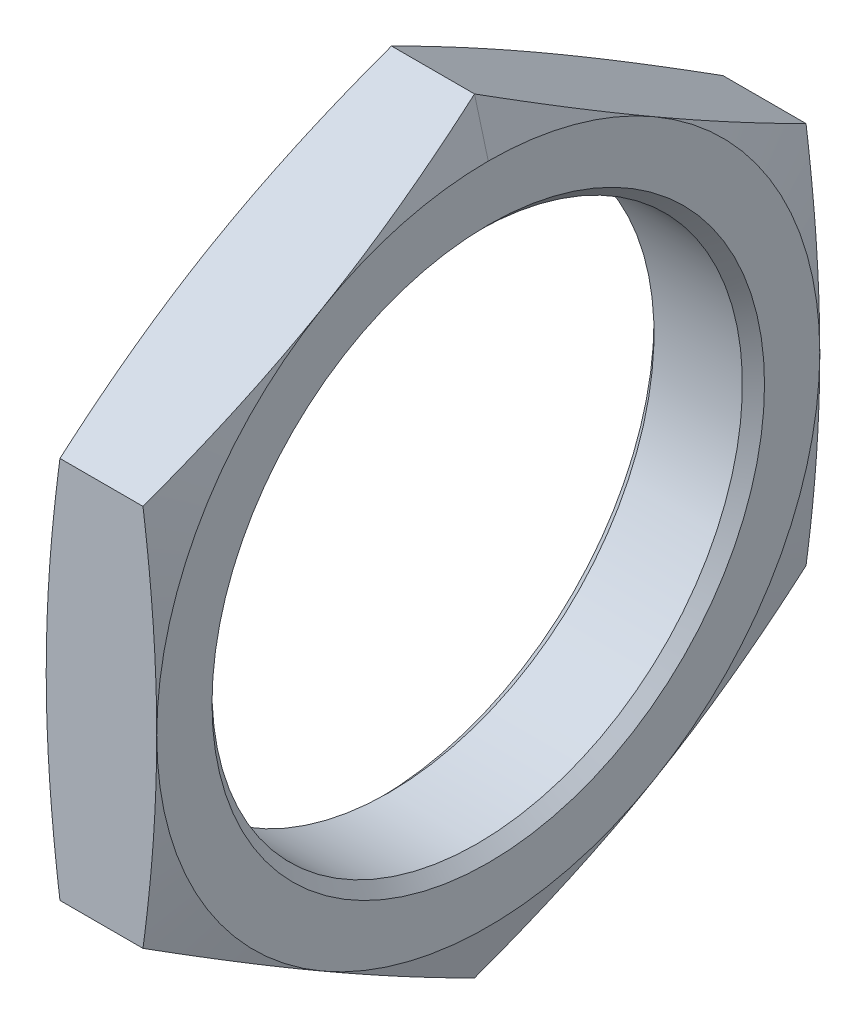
ISO-10303-21;
HEADER;
FILE_DESCRIPTION(('STEP AP214'),'2;1');
FILE_NAME('part.step','',(''),(''),'','','');
FILE_SCHEMA(('AUTOMOTIVE_DESIGN { 1 0 10303 214 1 1 1 1 }'));
ENDSEC;
DATA;
#1=APPLICATION_CONTEXT('core data for automotive mechanical design processes');
#2=APPLICATION_PROTOCOL_DEFINITION('international standard','automotive_design',2000,#1);
#3=PRODUCT_CONTEXT('',#1,'mechanical');
#4=PRODUCT('Part','Part','',(#3));
#5=PRODUCT_RELATED_PRODUCT_CATEGORY('part','',(#4));
#6=PRODUCT_DEFINITION_FORMATION('','',#4);
#7=PRODUCT_DEFINITION_CONTEXT('part definition',#1,'design');
#8=PRODUCT_DEFINITION('design','',#6,#7);
#9=PRODUCT_DEFINITION_SHAPE('','',#8);
#10=(LENGTH_UNIT() NAMED_UNIT(*) SI_UNIT(.MILLI.,.METRE.));
#11=(NAMED_UNIT(*) PLANE_ANGLE_UNIT() SI_UNIT($,.RADIAN.));
#12=(NAMED_UNIT(*) SI_UNIT($,.STERADIAN.) SOLID_ANGLE_UNIT());
#13=UNCERTAINTY_MEASURE_WITH_UNIT(LENGTH_MEASURE(1.E-05),#10,'distance_accuracy_value','');
#14=(GEOMETRIC_REPRESENTATION_CONTEXT(3) GLOBAL_UNCERTAINTY_ASSIGNED_CONTEXT((#13)) GLOBAL_UNIT_ASSIGNED_CONTEXT((#10,
#11,#12)) REPRESENTATION_CONTEXT('',''));
#15=CARTESIAN_POINT('',(0.,0.,0.));
#16=DIRECTION('',(0.,0.,1.));
#17=DIRECTION('',(1.,0.,0.));
#18=AXIS2_PLACEMENT_3D('',#15,#16,#17);
#19=CARTESIAN_POINT('',(2.5,8.660254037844,0.));
#20=DIRECTION('',(0.,0.866025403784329,0.50000000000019));
#21=DIRECTION('',(0.,-0.50000000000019,0.866025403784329));
#22=AXIS2_PLACEMENT_3D('',#19,#20,#21);
#23=PLANE('',#22);
#24=DIRECTION('',(1.,0.,0.));
#25=VECTOR('',#24,1.);
#26=CARTESIAN_POINT('',(2.5,4.330127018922,7.5));
#27=LINE('',#26,#25);
#28=CARTESIAN_POINT('',(2.18911087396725,4.33012704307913,7.49999995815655));
#29=VERTEX_POINT('',#28);
#30=CARTESIAN_POINT('',(0.3108891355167,4.33012704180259,7.5));
#31=VERTEX_POINT('',#30);
#32=EDGE_CURVE('E126',#29,#31,#27,.F.);
#33=ORIENTED_EDGE('',*,*,#32,.F.);
#34=CARTESIAN_POINT('',(2.50000000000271,6.49519024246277,3.75000049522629));
#35=CARTESIAN_POINT('',(2.50001030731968,6.40461333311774,3.90688430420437));
#36=CARTESIAN_POINT('',(2.49824156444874,6.31403715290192,4.06376685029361));
#37=CARTESIAN_POINT('',(2.49122190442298,6.13292132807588,4.37746866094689));
#38=CARTESIAN_POINT('',(2.48597109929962,6.04238168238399,4.53428792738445));
#39=CARTESIAN_POINT('',(2.47207107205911,5.86147021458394,4.84763578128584));
#40=CARTESIAN_POINT('',(2.46342568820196,5.77109831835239,5.00416449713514));
#41=CARTESIAN_POINT('',(2.44288009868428,5.59044748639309,5.31706091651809));
#42=CARTESIAN_POINT('',(2.43097988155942,5.50016855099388,5.47342861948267));
#43=CARTESIAN_POINT('',(2.3906607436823,5.22955342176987,5.94214777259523));
#44=CARTESIAN_POINT('',(2.35761929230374,5.04938862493,6.25420235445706));
#45=CARTESIAN_POINT('',(2.28090699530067,4.68941383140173,6.87769698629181));
#46=CARTESIAN_POINT('',(2.23722408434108,4.50960447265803,7.18913593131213));
#47=CARTESIAN_POINT('',(2.18911088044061,4.33012706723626,7.49999991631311));
#48=B_SPLINE_CURVE_WITH_KNOTS('',3,(#34,#35,#36,#37,#38,#39,#40,#41,#42,#43,#44,#45,#46,#47),
.UNSPECIFIED.,.F.,.F.,(4,2,2,2,2,2,4),(0.,0.543450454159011,1.08688342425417,1.62970369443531,
2.17252587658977,3.257868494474,4.34444745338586),.UNSPECIFIED.);
#49=CARTESIAN_POINT('',(2.50000000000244,6.49519038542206,3.75000024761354));
#50=VERTEX_POINT('',#49);
#51=EDGE_CURVE('E439',#50,#29,#48,.T.);
#52=ORIENTED_EDGE('',*,*,#51,.F.);
#53=CARTESIAN_POINT('',(2.18911086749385,8.66025403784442,-7.30962897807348E-13));
#54=CARTESIAN_POINT('',(2.23722408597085,8.48077658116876,0.310864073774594));
#55=CARTESIAN_POINT('',(2.28090700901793,8.30096717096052,0.62230310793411));
#56=CARTESIAN_POINT('',(2.35761932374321,7.94099227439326,1.24579791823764));
#57=CARTESIAN_POINT('',(2.39066078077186,7.7608274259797,1.5578525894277));
#58=CARTESIAN_POINT('',(2.43097992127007,7.49021221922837,2.02657187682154));
#59=CARTESIAN_POINT('',(2.44288013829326,7.39993325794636,2.18293962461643));
#60=CARTESIAN_POINT('',(2.46342572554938,7.21928237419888,2.49583613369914));
#61=CARTESIAN_POINT('',(2.47207110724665,7.12891045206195,2.65236489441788));
#62=CARTESIAN_POINT('',(2.48597112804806,6.94799893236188,2.96571283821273));
#63=CARTESIAN_POINT('',(2.49122192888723,6.85745926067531,3.12253214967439));
#64=CARTESIAN_POINT('',(2.49824157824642,6.67634338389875,3.43623405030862));
#65=CARTESIAN_POINT('',(2.50001031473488,6.58576717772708,3.59311664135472));
#66=CARTESIAN_POINT('',(2.50000000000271,6.49519024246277,3.75000049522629));
#67=B_SPLINE_CURVE_WITH_KNOTS('',3,(#53,#54,#55,#56,#57,#58,#59,#60,#61,#62,#63,#64,#65,#66),
.UNSPECIFIED.,.F.,.F.,(4,2,2,2,2,2,4),(0.,1.08657926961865,2.17192219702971,2.71474453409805,
3.2575649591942,3.80099808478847,4.34444869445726),.UNSPECIFIED.);
#68=CARTESIAN_POINT('',(2.18911086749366,8.66025403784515,-7.97653895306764E-13));
#69=VERTEX_POINT('',#68);
#70=EDGE_CURVE('E438',#69,#50,#67,.T.);
#71=ORIENTED_EDGE('',*,*,#70,.F.);
#72=DIRECTION('',(1.,0.,0.));
#73=VECTOR('',#72,1.);
#74=CARTESIAN_POINT('',(2.5,8.66025403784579,-1.03302782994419E-12));
#75=LINE('',#74,#73);
#76=CARTESIAN_POINT('',(0.310889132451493,8.66025403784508,-7.97955127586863E-13));
#77=VERTEX_POINT('',#76);
#78=EDGE_CURVE('E151',#77,#69,#75,.T.);
#79=ORIENTED_EDGE('',*,*,#78,.F.);
#80=CARTESIAN_POINT('',(-3.44138785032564E-13,6.49519052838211,3.74999999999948));
#81=CARTESIAN_POINT('',(-1.03110253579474E-05,6.58576745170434,3.59311616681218));
#82=CARTESIAN_POINT('',(0.00175842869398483,6.67634364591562,3.4362335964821));
#83=CARTESIAN_POINT('',(0.00877808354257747,6.85745949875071,3.12253173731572));
#84=CARTESIAN_POINT('',(0.0140288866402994,6.9479991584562,2.96571244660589));
#85=CARTESIAN_POINT('',(0.0279289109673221,7.12891065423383,2.65236454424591));
#86=CARTESIAN_POINT('',(0.0365742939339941,7.21928256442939,2.49583580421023));
#87=CARTESIAN_POINT('',(0.0571198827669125,7.39993342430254,2.18293933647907));
#88=CARTESIAN_POINT('',(0.0690201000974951,7.49021237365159,2.02657160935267));
#89=CARTESIAN_POINT('',(0.109339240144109,7.76082754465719,1.55785238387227));
#90=CARTESIAN_POINT('',(0.142380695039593,7.94099236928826,1.24579775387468));
#91=CARTESIAN_POINT('',(0.2190930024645,8.30096721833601,0.62230302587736));
#92=CARTESIAN_POINT('',(0.26277592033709,8.48077660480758,0.310864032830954));
#93=CARTESIAN_POINT('',(0.310889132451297,8.66025403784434,-5.98522007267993E-13));
#94=B_SPLINE_CURVE_WITH_KNOTS('',3,(#80,#81,#82,#83,#84,#85,#86,#87,#88,#89,#90,#91,#92,#93),
.UNSPECIFIED.,.F.,.F.,(4,2,2,2,2,2,4),(0.,0.543450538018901,1.08688359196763,1.62970394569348,
2.17252621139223,3.25786899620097,4.34444812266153),.UNSPECIFIED.);
#95=CARTESIAN_POINT('',(0.,6.49519052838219,3.7500000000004));
#96=VERTEX_POINT('',#95);
#97=EDGE_CURVE('E149',#96,#77,#94,.T.);
#98=ORIENTED_EDGE('',*,*,#97,.F.);
#99=CARTESIAN_POINT('',(0.310889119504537,4.33012706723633,7.49999991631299));
#100=CARTESIAN_POINT('',(0.262775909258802,4.50960449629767,7.18913589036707));
#101=CARTESIAN_POINT('',(0.219092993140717,4.68941387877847,6.87769690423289));
#102=CARTESIAN_POINT('',(0.142380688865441,5.04938871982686,6.25420219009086));
#103=CARTESIAN_POINT('',(0.109339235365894,5.2295535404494,5.94214756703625));
#104=CARTESIAN_POINT('',(0.0690200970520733,5.50016870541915,5.47342835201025));
#105=CARTESIAN_POINT('',(0.057119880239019,5.59044765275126,5.31706062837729));
#106=CARTESIAN_POINT('',(0.036574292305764,5.77109850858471,5.0041641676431));
#107=CARTESIAN_POINT('',(0.0279289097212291,5.86147041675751,4.84763543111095));
#108=CARTESIAN_POINT('',(0.014028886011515,6.04238190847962,4.53428753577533));
#109=CARTESIAN_POINT('',(0.00877808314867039,6.13292156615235,4.37746824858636));
#110=CARTESIAN_POINT('',(0.00175842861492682,6.31403741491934,4.06376639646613));
#111=CARTESIAN_POINT('',(-1.03110244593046E-05,6.40461360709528,3.90688382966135));
#112=CARTESIAN_POINT('',(-3.44248901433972E-13,6.49519052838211,3.74999999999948));
#113=B_SPLINE_CURVE_WITH_KNOTS('',3,(#99,#100,#101,#102,#103,#104,#105,#106,#107,#108,#109,#110,
#111,#112),.UNSPECIFIED.,.F.,.F.,(4,2,2,2,2,2,4),(0.,1.08657910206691,2.17192186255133,
2.7147441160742,3.25756445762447,3.80099749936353,4.3444480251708),.UNSPECIFIED.);
#114=EDGE_CURVE('E21',#31,#96,#113,.T.);
#115=ORIENTED_EDGE('',*,*,#114,.F.);
#116=EDGE_LOOP('',(#33,#52,#71,#79,#98,#115));
#117=FACE_BOUND('',#116,.T.);
#118=ADVANCED_FACE('F17',(#117),#23,.T.);
#119=CARTESIAN_POINT('',(2.5,4.330127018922,7.5));
#120=DIRECTION('',(0.,0.,1.));
#121=DIRECTION('',(1.,0.,0.));
#122=AXIS2_PLACEMENT_3D('',#119,#120,#121);
#123=PLANE('',#122);
#124=DIRECTION('',(1.,0.,0.));
#125=VECTOR('',#124,1.);
#126=CARTESIAN_POINT('',(2.5,-4.330127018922,7.5));
#127=LINE('',#126,#125);
#128=CARTESIAN_POINT('',(2.18911087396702,-4.33012697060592,7.5));
#129=VERTEX_POINT('',#128);
#130=CARTESIAN_POINT('',(0.310889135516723,-4.33012700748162,7.50000001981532));
#131=VERTEX_POINT('',#130);
#132=EDGE_CURVE('E138',#129,#131,#127,.F.);
#133=ORIENTED_EDGE('',*,*,#132,.F.);
#134=CARTESIAN_POINT('',(2.50000000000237,0.,7.5));
#135=CARTESIAN_POINT('',(2.50001031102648,-0.181153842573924,7.5));
#136=CARTESIAN_POINT('',(2.49824157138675,-0.362306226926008,7.5));
#137=CARTESIAN_POINT('',(2.49122191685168,-0.724537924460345,7.5));
#138=CARTESIAN_POINT('',(2.48597111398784,-0.905617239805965,7.5));
#139=CARTESIAN_POINT('',(2.47207109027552,-1.2674402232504,7.5));
#140=CARTESIAN_POINT('',(2.46342570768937,-1.44818403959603,7.5));
#141=CARTESIAN_POINT('',(2.44288011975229,-1.80948575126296,7.5));
#142=CARTESIAN_POINT('',(2.43097990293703,-1.99004364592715,7.5));
#143=CARTESIAN_POINT('',(2.39066076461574,-2.53127397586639,7.5));
#144=CARTESIAN_POINT('',(2.35761931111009,-2.89160361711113,7.5));
#145=CARTESIAN_POINT('',(2.28090700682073,-3.61155329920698,7.5));
#146=CARTESIAN_POINT('',(2.23722409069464,-3.97117206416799,7.5));
#147=CARTESIAN_POINT('',(2.18911088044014,-4.33012692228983,7.5));
#148=B_SPLINE_CURVE_WITH_KNOTS('',3,(#134,#135,#136,#137,#138,#139,#140,#141,#142,#143,#144,
#145,#146,#147),.UNSPECIFIED.,.F.,.F.,(4,2,2,2,2,2,4),(0.,0.543450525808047,1.08688356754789,
1.62970390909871,2.17252616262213,3.25786892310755,4.3444480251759),.UNSPECIFIED.);
#149=CARTESIAN_POINT('',(2.50000000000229,0.,7.5000000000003));
#150=VERTEX_POINT('',#149);
#151=EDGE_CURVE('E355',#150,#129,#148,.T.);
#152=ORIENTED_EDGE('',*,*,#151,.F.);
#153=CARTESIAN_POINT('',(2.18911086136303,4.33012706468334,7.5));
#154=CARTESIAN_POINT('',(2.23722407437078,3.97117219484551,7.5));
#155=CARTESIAN_POINT('',(2.28090699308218,3.61155341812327,7.5));
#156=CARTESIAN_POINT('',(2.3576193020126,2.89160371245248,7.5));
#157=CARTESIAN_POINT('',(2.39066075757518,2.5312740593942,7.5));
#158=CARTESIAN_POINT('',(2.43097989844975,1.99004371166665,7.5));
#159=CARTESIAN_POINT('',(2.4428801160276,1.80948581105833,7.5));
#160=CARTESIAN_POINT('',(2.46342570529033,1.44818408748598,7.5));
#161=CARTESIAN_POINT('',(2.47207108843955,1.26744026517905,7.5));
#162=CARTESIAN_POINT('',(2.48597111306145,0.905617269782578,7.5));
#163=CARTESIAN_POINT('',(2.49122191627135,0.724537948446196,7.5));
#164=CARTESIAN_POINT('',(2.49824157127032,0.362306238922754,7.5));
#165=CARTESIAN_POINT('',(2.50001031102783,0.181153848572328,7.5));
#166=CARTESIAN_POINT('',(2.50000000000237,0.,7.5));
#167=B_SPLINE_CURVE_WITH_KNOTS('',3,(#153,#154,#155,#156,#157,#158,#159,#160,#161,#162,#163,
#164,#165,#166),.UNSPECIFIED.,.F.,.F.,(4,2,2,2,2,2,4),(0.,1.08657913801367,2.17192193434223,
2.71474420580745,3.25756456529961,3.80099762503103,4.34444816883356),.UNSPECIFIED.);
#168=EDGE_CURVE('E134',#29,#150,#167,.T.);
#169=ORIENTED_EDGE('',*,*,#168,.F.);
#170=ORIENTED_EDGE('',*,*,#32,.T.);
#171=CARTESIAN_POINT('',(0.,0.,7.5));
#172=CARTESIAN_POINT('',(-1.03110254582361E-05,0.181153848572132,7.5));
#173=CARTESIAN_POINT('',(0.00175842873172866,0.362306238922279,7.5));
#174=CARTESIAN_POINT('',(0.00877808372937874,0.724537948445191,7.5));
#175=CARTESIAN_POINT('',(0.0140288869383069,0.905617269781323,7.5));
#176=CARTESIAN_POINT('',(0.0279289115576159,1.26744026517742,7.5));
#177=CARTESIAN_POINT('',(0.0365742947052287,1.44818408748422,7.5));
#178=CARTESIAN_POINT('',(0.0571198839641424,1.80948581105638,7.5));
#179=CARTESIAN_POINT('',(0.0690201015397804,1.99004371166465,7.5));
#180=CARTESIAN_POINT('',(0.109339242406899,2.53127405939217,7.5));
#181=CARTESIAN_POINT('',(0.142380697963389,2.89160371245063,7.5));
#182=CARTESIAN_POINT('',(0.21909300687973,3.61155341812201,7.5));
#183=CARTESIAN_POINT('',(0.26277592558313,3.97117219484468,7.5));
#184=CARTESIAN_POINT('',(0.310889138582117,4.33012706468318,7.5));
#185=B_SPLINE_CURVE_WITH_KNOTS('',3,(#171,#172,#173,#174,#175,#176,#177,#178,#179,#180,#181,
#182,#183,#184),.UNSPECIFIED.,.F.,.F.,(4,2,2,2,2,2,4),(0.,0.543450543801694,1.08688360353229,
1.62970396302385,2.17252623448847,3.25786903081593,4.34444816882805),.UNSPECIFIED.);
#186=CARTESIAN_POINT('',(0.,0.,7.5));
#187=VERTEX_POINT('',#186);
#188=EDGE_CURVE('E131',#187,#31,#185,.T.);
#189=ORIENTED_EDGE('',*,*,#188,.F.);
#190=CARTESIAN_POINT('',(0.310889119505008,-4.3301269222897,7.5));
#191=CARTESIAN_POINT('',(0.262775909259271,-3.97117206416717,7.5));
#192=CARTESIAN_POINT('',(0.219092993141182,-3.61155329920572,7.5));
#193=CARTESIAN_POINT('',(0.142380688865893,-2.89160361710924,7.5));
#194=CARTESIAN_POINT('',(0.109339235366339,-2.53127397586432,7.5));
#195=CARTESIAN_POINT('',(0.0690200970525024,-1.99004364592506,7.5));
#196=CARTESIAN_POINT('',(0.0571198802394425,-1.80948575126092,7.5));
#197=CARTESIAN_POINT('',(0.0365742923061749,-1.44818403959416,7.5));
#198=CARTESIAN_POINT('',(0.0279289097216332,-1.26744022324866,7.5));
#199=CARTESIAN_POINT('',(0.0140288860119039,-0.905617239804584,7.5));
#200=CARTESIAN_POINT('',(0.00877808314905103,-0.724537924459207,7.5));
#201=CARTESIAN_POINT('',(0.00175842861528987,-0.362306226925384,7.5));
#202=CARTESIAN_POINT('',(-1.03110241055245E-05,-0.181153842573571,7.5));
#203=CARTESIAN_POINT('',(0.,0.,7.5));
#204=B_SPLINE_CURVE_WITH_KNOTS('',3,(#190,#191,#192,#193,#194,#195,#196,#197,#198,#199,#200,
#201,#202,#203),.UNSPECIFIED.,.F.,.F.,(4,2,2,2,2,2,4),(0.,1.08657910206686,2.17192186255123,
2.71474411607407,3.25756445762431,3.80099749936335,4.34444802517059),.UNSPECIFIED.);
#205=EDGE_CURVE('E146',#131,#187,#204,.T.);
#206=ORIENTED_EDGE('',*,*,#205,.F.);
#207=EDGE_LOOP('',(#133,#152,#169,#170,#189,#206));
#208=FACE_BOUND('',#207,.T.);
#209=ADVANCED_FACE('F129',(#208),#123,.T.);
#210=CARTESIAN_POINT('',(2.5,-4.330127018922,7.5));
#211=DIRECTION('',(0.,-0.866025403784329,0.50000000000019));
#212=DIRECTION('',(0.,-0.50000000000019,-0.866025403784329));
#213=AXIS2_PLACEMENT_3D('',#210,#211,#212);
#214=PLANE('',#213);
#215=DIRECTION('',(1.,0.,0.));
#216=VECTOR('',#215,1.);
#217=CARTESIAN_POINT('',(2.5,-8.660254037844,0.));
#218=LINE('',#217,#216);
#219=CARTESIAN_POINT('',(2.18911087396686,-8.66025401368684,4.18434947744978E-08));
#220=VERTEX_POINT('',#219);
#221=CARTESIAN_POINT('',(0.31088913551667,-8.66025404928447,1.98154801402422E-08));
#222=VERTEX_POINT('',#221);
#223=EDGE_CURVE('E165',#220,#222,#218,.F.);
#224=ORIENTED_EDGE('',*,*,#223,.F.);
#225=CARTESIAN_POINT('',(2.50000000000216,-6.49519026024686,3.75000046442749));
#226=CARTESIAN_POINT('',(2.50001031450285,-6.58576719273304,3.59311661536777));
#227=CARTESIAN_POINT('',(2.49824157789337,-6.67634339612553,3.43623402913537));
#228=CARTESIAN_POINT('',(2.4912219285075,-6.857459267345,3.12253213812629));
#229=CARTESIAN_POINT('',(2.48597112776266,-6.94799893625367,2.9657128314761));
#230=CARTESIAN_POINT('',(2.4720711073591,-7.1289104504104,2.65236489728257));
#231=CARTESIAN_POINT('',(2.4634257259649,-7.21928236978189,2.49583614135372));
#232=CARTESIAN_POINT('',(2.44288013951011,-7.39993324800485,2.18293964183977));
#233=CARTESIAN_POINT('',(2.43097992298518,-7.49021220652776,2.02657189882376));
#234=CARTESIAN_POINT('',(2.39066078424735,-7.76082740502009,1.55785262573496));
#235=CARTESIAN_POINT('',(2.35761932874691,-7.94099224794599,1.24579796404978));
#236=CARTESIAN_POINT('',(2.28090701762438,-8.30096713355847,0.622303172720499));
#237=CARTESIAN_POINT('',(2.23722409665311,-8.48077653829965,0.310864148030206));
#238=CARTESIAN_POINT('',(2.18911088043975,-8.66025398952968,8.36869910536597E-08));
#239=B_SPLINE_CURVE_WITH_KNOTS('',3,(#225,#226,#227,#228,#229,#230,#231,#232,#233,#234,#235,
#236,#237,#238),.UNSPECIFIED.,.F.,.F.,(4,2,2,2,2,2,4),(0.,0.543450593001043,1.0868837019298,
1.62970411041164,2.1725264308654,3.25786932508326,4.34444856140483),.UNSPECIFIED.);
#240=CARTESIAN_POINT('',(2.50000000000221,-6.495190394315,3.75000023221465));
#241=VERTEX_POINT('',#240);
#242=EDGE_CURVE('E326',#241,#220,#239,.T.);
#243=ORIENTED_EDGE('',*,*,#242,.F.);
#244=CARTESIAN_POINT('',(2.18911086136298,-4.33012699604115,7.50000003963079));
#245=CARTESIAN_POINT('',(2.23722406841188,-4.50960440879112,7.18913604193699));
#246=CARTESIAN_POINT('',(2.2809069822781,-4.68941377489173,6.87769708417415));
#247=CARTESIAN_POINT('',(2.35761928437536,-5.04938858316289,6.25420242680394));
#248=CARTESIAN_POINT('',(2.39066073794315,-5.22955338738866,5.94214783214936));
#249=CARTESIAN_POINT('',(2.43097987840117,-5.50016852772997,5.47342865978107));
#250=CARTESIAN_POINT('',(2.44288009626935,-5.5904474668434,5.31706095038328));
#251=CARTESIAN_POINT('',(2.46342568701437,-5.77109830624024,5.00416451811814));
#252=CARTESIAN_POINT('',(2.47207107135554,-5.86147020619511,4.84763579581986));
#253=CARTESIAN_POINT('',(2.4859710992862,-6.04238168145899,4.53428792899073));
#254=CARTESIAN_POINT('',(2.49122190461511,-6.1329213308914,4.37746865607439));
#255=CARTESIAN_POINT('',(2.49824156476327,-6.31403716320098,4.06376683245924));
#256=CARTESIAN_POINT('',(2.50001030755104,-6.40461334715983,3.90688427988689));
#257=CARTESIAN_POINT('',(2.50000000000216,-6.49519026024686,3.75000046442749));
#258=B_SPLINE_CURVE_WITH_KNOTS('',3,(#244,#245,#246,#247,#248,#249,#250,#251,#252,#253,#254,
#255,#256,#257),.UNSPECIFIED.,.F.,.F.,(4,2,2,2,2,2,4),(0.,1.0865790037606,2.17192166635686,
2.71474387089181,3.25756416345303,3.80099715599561,4.34444763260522),.UNSPECIFIED.);
#259=EDGE_CURVE('E350',#129,#241,#258,.T.);
#260=ORIENTED_EDGE('',*,*,#259,.F.);
#261=ORIENTED_EDGE('',*,*,#132,.T.);
#262=CARTESIAN_POINT('',(2.09519658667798E-13,-6.49519052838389,3.75000000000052));
#263=CARTESIAN_POINT('',(-1.03110252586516E-05,-6.40461360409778,3.9068838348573));
#264=CARTESIAN_POINT('',(0.00175842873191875,-6.31403740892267,4.0637664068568));
#265=CARTESIAN_POINT('',(0.00877808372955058,-6.13292155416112,4.3774682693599));
#266=CARTESIAN_POINT('',(0.0140288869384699,-6.04238189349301,4.53428756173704));
#267=CARTESIAN_POINT('',(0.027928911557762,-5.86147039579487,4.84763546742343));
#268=CARTESIAN_POINT('',(0.0365742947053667,-5.77109848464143,5.00416420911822));
#269=CARTESIAN_POINT('',(0.0571198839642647,-5.59044762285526,5.31706068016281));
#270=CARTESIAN_POINT('',(0.0690201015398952,-5.50016867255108,5.47342840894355));
#271=CARTESIAN_POINT('',(0.109339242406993,-5.22955349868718,5.94214763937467));
#272=CARTESIAN_POINT('',(0.142380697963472,-5.04938867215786,6.25420227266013));
#273=CARTESIAN_POINT('',(0.219093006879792,-4.68941381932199,6.87769700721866));
#274=CARTESIAN_POINT('',(0.262775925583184,-4.50960443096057,7.18913600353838));
#275=CARTESIAN_POINT('',(0.310889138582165,-4.33012699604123,7.50000003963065));
#276=B_SPLINE_CURVE_WITH_KNOTS('',3,(#262,#263,#264,#265,#266,#267,#268,#269,#270,#271,#272,
#273,#274,#275),.UNSPECIFIED.,.F.,.F.,(4,2,2,2,2,2,4),(0.,0.543450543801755,1.08688360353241,
1.62970396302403,2.17252623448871,3.25786903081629,4.34444816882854),.UNSPECIFIED.);
#277=CARTESIAN_POINT('',(0.,-6.49519052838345,3.75000000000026));
#278=VERTEX_POINT('',#277);
#279=EDGE_CURVE('E374',#278,#131,#276,.T.);
#280=ORIENTED_EDGE('',*,*,#279,.F.);
#281=CARTESIAN_POINT('',(0.310889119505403,-8.66025398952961,8.36871083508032E-08));
#282=CARTESIAN_POINT('',(0.262775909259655,-8.48077656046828,0.310864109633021));
#283=CARTESIAN_POINT('',(0.219092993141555,-8.30096717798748,0.622303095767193));
#284=CARTESIAN_POINT('',(0.14238068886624,-7.9409923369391,1.2457978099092));
#285=CARTESIAN_POINT('',(0.109339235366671,-7.76082751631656,1.55785243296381));
#286=CARTESIAN_POINT('',(0.0690200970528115,-7.49021235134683,2.02657164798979));
#287=CARTESIAN_POINT('',(0.0571198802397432,-7.39993340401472,2.18293937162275));
#288=CARTESIAN_POINT('',(0.0365742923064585,-7.21928254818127,2.49583583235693));
#289=CARTESIAN_POINT('',(0.0279289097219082,-7.12891064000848,2.65236456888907));
#290=CARTESIAN_POINT('',(0.0140288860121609,-6.94799914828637,2.96571246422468));
#291=CARTESIAN_POINT('',(0.00877808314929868,-6.85745949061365,3.12253175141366));
#292=CARTESIAN_POINT('',(0.00175842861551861,-6.67634364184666,3.43623360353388));
#293=CARTESIAN_POINT('',(-1.03110238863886E-05,-6.58576744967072,3.59311617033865));
#294=CARTESIAN_POINT('',(2.0961750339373E-13,-6.49519052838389,3.75000000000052));
#295=B_SPLINE_CURVE_WITH_KNOTS('',3,(#281,#282,#283,#284,#285,#286,#287,#288,#289,#290,#291,
#292,#293,#294),.UNSPECIFIED.,.F.,.F.,(4,2,2,2,2,2,4),(0.,1.08657910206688,2.17192186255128,
2.71474411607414,3.25756445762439,3.80099749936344,4.3444480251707),.UNSPECIFIED.);
#296=EDGE_CURVE('E396',#222,#278,#295,.T.);
#297=ORIENTED_EDGE('',*,*,#296,.F.);
#298=EDGE_LOOP('',(#224,#243,#260,#261,#280,#297));
#299=FACE_BOUND('',#298,.T.);
#300=ADVANCED_FACE('F306',(#299),#214,.T.);
#301=CARTESIAN_POINT('',(2.5,-8.660254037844,0.));
#302=DIRECTION('',(0.,-0.866025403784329,-0.50000000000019));
#303=DIRECTION('',(0.,0.50000000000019,-0.866025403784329));
#304=AXIS2_PLACEMENT_3D('',#301,#302,#303);
#305=PLANE('',#304);
#306=DIRECTION('',(-1.,0.,0.));
#307=VECTOR('',#306,1.);
#308=CARTESIAN_POINT('',(2.5,-4.330127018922,-7.5));
#309=LINE('',#308,#307);
#310=CARTESIAN_POINT('',(2.18911086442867,-4.33012700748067,-7.5000000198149));
#311=VERTEX_POINT('',#310);
#312=CARTESIAN_POINT('',(0.31088912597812,-4.33012697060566,-7.5));
#313=VERTEX_POINT('',#312);
#314=EDGE_CURVE('E158',#311,#313,#309,.T.);
#315=ORIENTED_EDGE('',*,*,#314,.F.);
#316=CARTESIAN_POINT('',(2.50000000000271,-6.49519026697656,-3.75000045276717));
#317=CARTESIAN_POINT('',(2.50001030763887,-6.40461335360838,-3.90688426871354));
#318=CARTESIAN_POINT('',(2.49824156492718,-6.31403716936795,-4.06376682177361));
#319=CARTESIAN_POINT('',(2.49122190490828,-6.13292133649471,-4.37746864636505));
#320=CARTESIAN_POINT('',(2.48597109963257,-6.04238168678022,-4.53428791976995));
#321=CARTESIAN_POINT('',(2.47207107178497,-5.86147021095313,-4.84763578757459));
#322=CARTESIAN_POINT('',(2.46342568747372,-5.77109831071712,-5.00416451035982));
#323=CARTESIAN_POINT('',(2.44288009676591,-5.5904474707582,-5.31706094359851));
#324=CARTESIAN_POINT('',(2.43097987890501,-5.50016853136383,-5.47342865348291));
#325=CARTESIAN_POINT('',(2.39066073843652,-5.22955339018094,-5.94214782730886));
#326=CARTESIAN_POINT('',(2.35761928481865,-5.04938858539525,-6.25420242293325));
#327=CARTESIAN_POINT('',(2.28090698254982,-4.68941377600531,-6.87769708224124));
#328=CARTESIAN_POINT('',(2.23722406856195,-4.50960440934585,-7.18913604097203));
#329=CARTESIAN_POINT('',(2.18911086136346,-4.33012699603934,-7.5000000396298));
#330=B_SPLINE_CURVE_WITH_KNOTS('',3,(#316,#317,#318,#319,#320,#321,#322,#323,#324,#325,#326,
#327,#328,#329),.UNSPECIFIED.,.F.,.F.,(4,2,2,2,2,2,4),(0.,0.543450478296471,1.08688347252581,
1.62970376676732,2.17252597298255,3.25786863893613,4.34444764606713),.UNSPECIFIED.);
#331=CARTESIAN_POINT('',(2.50000000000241,-6.49519039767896,-3.75000022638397));
#332=VERTEX_POINT('',#331);
#333=EDGE_CURVE('E311',#332,#311,#330,.T.);
#334=ORIENTED_EDGE('',*,*,#333,.F.);
#335=CARTESIAN_POINT('',(2.18911086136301,-8.66025406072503,3.96311016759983E-08));
#336=CARTESIAN_POINT('',(2.23722408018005,-8.48077660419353,-0.31086403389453));
#337=CARTESIAN_POINT('',(2.28090700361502,-8.30096719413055,-0.622303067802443));
#338=CARTESIAN_POINT('',(2.3576193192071,-7.94099229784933,-1.24579787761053));
#339=CARTESIAN_POINT('',(2.39066077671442,-7.76082744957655,-1.55785254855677));
#340=CARTESIAN_POINT('',(2.43097991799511,-7.49021224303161,-2.02657183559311));
#341=CARTESIAN_POINT('',(2.44288013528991,-7.39993328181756,-2.1829395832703));
#342=CARTESIAN_POINT('',(2.46342572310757,-7.21928239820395,-2.49583609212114));
#343=CARTESIAN_POINT('',(2.47207110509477,-7.12891047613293,-2.65236485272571));
#344=CARTESIAN_POINT('',(2.48597112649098,-6.94799895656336,-2.96571279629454));
#345=CARTESIAN_POINT('',(2.4912219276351,-6.85745928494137,-3.12253210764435));
#346=CARTESIAN_POINT('',(2.49824157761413,-6.67634340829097,-3.43623400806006));
#347=CARTESIAN_POINT('',(2.50001031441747,-6.58576720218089,-3.59311659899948));
#348=CARTESIAN_POINT('',(2.50000000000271,-6.49519026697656,-3.75000045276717));
#349=B_SPLINE_CURVE_WITH_KNOTS('',3,(#335,#336,#337,#338,#339,#340,#341,#342,#343,#344,#345,
#346,#347,#348),.UNSPECIFIED.,.F.,.F.,(4,2,2,2,2,2,4),(0.,1.08657926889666,2.17192219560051,
2.71474453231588,3.25756495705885,3.80099808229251,4.34444869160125),.UNSPECIFIED.);
#350=EDGE_CURVE('E319',#220,#332,#349,.T.);
#351=ORIENTED_EDGE('',*,*,#350,.F.);
#352=ORIENTED_EDGE('',*,*,#223,.T.);
#353=CARTESIAN_POINT('',(-3.44056520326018E-13,-6.49519052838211,-3.74999999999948));
#354=CARTESIAN_POINT('',(-1.03110257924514E-05,-6.58576745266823,-3.59311616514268));
#355=CARTESIAN_POINT('',(0.00175842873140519,-6.67634364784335,-3.43623359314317));
#356=CARTESIAN_POINT('',(0.00877808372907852,-6.85745950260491,-3.12253173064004));
#357=CARTESIAN_POINT('',(0.0140288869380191,-6.94799916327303,-2.96571243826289));
#358=CARTESIAN_POINT('',(0.0279289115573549,-7.12891066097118,-2.65236453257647));
#359=CARTESIAN_POINT('',(0.0365742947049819,-7.21928257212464,-2.49583579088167));
#360=CARTESIAN_POINT('',(0.0571198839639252,-7.39993343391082,-2.18293931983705));
#361=CARTESIAN_POINT('',(0.0690201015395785,-7.49021238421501,-2.0265715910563));
#362=CARTESIAN_POINT('',(0.109339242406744,-7.76082755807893,-1.55785236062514));
#363=CARTESIAN_POINT('',(0.142380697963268,-7.94099238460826,-1.24579772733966));
#364=CARTESIAN_POINT('',(0.219093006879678,-8.30096723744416,-0.62230299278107));
#365=CARTESIAN_POINT('',(0.262775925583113,-8.4807766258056,-0.310863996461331));
#366=CARTESIAN_POINT('',(0.310889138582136,-8.66025406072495,3.96309623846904E-08));
#367=B_SPLINE_CURVE_WITH_KNOTS('',3,(#353,#354,#355,#356,#357,#358,#359,#360,#361,#362,#363,
#364,#365,#366),.UNSPECIFIED.,.F.,.F.,(4,2,2,2,2,2,4),(0.,0.543450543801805,1.08688360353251,
1.62970396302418,2.17252623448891,3.25786903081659,4.34444816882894),.UNSPECIFIED.);
#368=CARTESIAN_POINT('',(-2.03489906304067E-13,-6.49519052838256,-3.74999999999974));
#369=VERTEX_POINT('',#368);
#370=EDGE_CURVE('E392',#369,#222,#367,.T.);
#371=ORIENTED_EDGE('',*,*,#370,.F.);
#372=CARTESIAN_POINT('',(0.310889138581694,-4.33012699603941,-7.50000003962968));
#373=CARTESIAN_POINT('',(0.262775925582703,-4.50960443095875,-7.1891360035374));
#374=CARTESIAN_POINT('',(0.2190930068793,-4.68941381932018,-6.87769700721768));
#375=CARTESIAN_POINT('',(0.142380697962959,-5.04938867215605,-6.25420227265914));
#376=CARTESIAN_POINT('',(0.109339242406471,-5.22955349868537,-5.94214763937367));
#377=CARTESIAN_POINT('',(0.0690201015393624,-5.50016867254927,-5.47342840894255));
#378=CARTESIAN_POINT('',(0.0571198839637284,-5.59044762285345,-5.31706068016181));
#379=CARTESIAN_POINT('',(0.0365742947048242,-5.77109848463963,-5.00416420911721));
#380=CARTESIAN_POINT('',(0.0279289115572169,-5.86147039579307,-4.84763546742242));
#381=CARTESIAN_POINT('',(0.0140288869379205,-6.04238189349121,-4.53428756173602));
#382=CARTESIAN_POINT('',(0.00877808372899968,-6.13292155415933,-4.37746826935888));
#383=CARTESIAN_POINT('',(0.00175842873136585,-6.31403740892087,-4.06376640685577));
#384=CARTESIAN_POINT('',(-1.03110258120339E-05,-6.40461360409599,-3.90688383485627));
#385=CARTESIAN_POINT('',(-3.43877468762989E-13,-6.49519052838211,-3.74999999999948));
#386=B_SPLINE_CURVE_WITH_KNOTS('',3,(#372,#373,#374,#375,#376,#377,#378,#379,#380,#381,#382,
#383,#384,#385),.UNSPECIFIED.,.F.,.F.,(4,2,2,2,2,2,4),(0.,1.08657913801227,2.17192193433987,
2.71474420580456,3.25756456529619,3.80099762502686,4.34444816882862),.UNSPECIFIED.);
#387=EDGE_CURVE('E292',#313,#369,#386,.T.);
#388=ORIENTED_EDGE('',*,*,#387,.F.);
#389=EDGE_LOOP('',(#315,#334,#351,#352,#371,#388));
#390=FACE_BOUND('',#389,.T.);
#391=ADVANCED_FACE('F302',(#390),#305,.T.);
#392=CARTESIAN_POINT('',(2.5,-4.330127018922,-7.5));
#393=DIRECTION('',(0.,0.,-1.));
#394=DIRECTION('',(-1.,0.,0.));
#395=AXIS2_PLACEMENT_3D('',#392,#393,#394);
#396=PLANE('',#395);
#397=DIRECTION('',(1.,0.,0.));
#398=VECTOR('',#397,1.);
#399=CARTESIAN_POINT('',(2.5,4.330127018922,-7.5));
#400=LINE('',#399,#398);
#401=CARTESIAN_POINT('',(2.18911086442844,4.33012704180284,-7.5));
#402=VERTEX_POINT('',#401);
#403=CARTESIAN_POINT('',(0.310889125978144,4.33012704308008,-7.49999995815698));
#404=VERTEX_POINT('',#403);
#405=EDGE_CURVE('E152',#402,#404,#400,.F.);
#406=ORIENTED_EDGE('',*,*,#405,.F.);
#407=CARTESIAN_POINT('',(2.50000000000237,0.,-7.5));
#408=CARTESIAN_POINT('',(2.50001031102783,0.181153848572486,-7.5));
#409=CARTESIAN_POINT('',(2.49824157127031,0.362306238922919,-7.5));
#410=CARTESIAN_POINT('',(2.49122191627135,0.724537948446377,-7.5));
#411=CARTESIAN_POINT('',(2.48597111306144,0.905617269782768,-7.5));
#412=CARTESIAN_POINT('',(2.47207108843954,1.26744026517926,-7.5));
#413=CARTESIAN_POINT('',(2.46342570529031,1.44818408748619,-7.5));
#414=CARTESIAN_POINT('',(2.44288011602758,1.80948581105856,-7.5));
#415=CARTESIAN_POINT('',(2.43097989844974,1.99004371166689,-7.5));
#416=CARTESIAN_POINT('',(2.39066075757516,2.53127405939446,-7.5));
#417=CARTESIAN_POINT('',(2.35761930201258,2.89160371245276,-7.5));
#418=CARTESIAN_POINT('',(2.28090699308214,3.61155341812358,-7.5));
#419=CARTESIAN_POINT('',(2.23722407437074,3.97117219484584,-7.5));
#420=CARTESIAN_POINT('',(2.18911086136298,4.33012706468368,-7.5));
#421=B_SPLINE_CURVE_WITH_KNOTS('',3,(#407,#408,#409,#410,#411,#412,#413,#414,#415,#416,#417,
#418,#419,#420),.UNSPECIFIED.,.F.,.F.,(4,2,2,2,2,2,4),(0.,0.543450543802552,1.08688360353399,
1.62970396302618,2.17252623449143,3.25786903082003,4.34444816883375),.UNSPECIFIED.);
#422=CARTESIAN_POINT('',(2.50000000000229,0.,-7.5000000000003));
#423=VERTEX_POINT('',#422);
#424=EDGE_CURVE('E225',#423,#402,#421,.T.);
#425=ORIENTED_EDGE('',*,*,#424,.F.);
#426=CARTESIAN_POINT('',(2.18911088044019,-4.3301269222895,-7.5));
#427=CARTESIAN_POINT('',(2.23722409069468,-3.97117206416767,-7.5));
#428=CARTESIAN_POINT('',(2.28090700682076,-3.61155329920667,-7.5));
#429=CARTESIAN_POINT('',(2.35761931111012,-2.89160361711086,-7.5));
#430=CARTESIAN_POINT('',(2.39066076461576,-2.53127397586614,-7.5));
#431=CARTESIAN_POINT('',(2.43097990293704,-1.99004364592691,-7.5));
#432=CARTESIAN_POINT('',(2.44288011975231,-1.80948575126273,-7.5));
#433=CARTESIAN_POINT('',(2.46342570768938,-1.44818403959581,-7.5));
#434=CARTESIAN_POINT('',(2.47207109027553,-1.2674402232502,-7.5));
#435=CARTESIAN_POINT('',(2.48597111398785,-0.905617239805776,-7.5));
#436=CARTESIAN_POINT('',(2.49122191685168,-0.724537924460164,-7.5));
#437=CARTESIAN_POINT('',(2.49824157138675,-0.362306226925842,-7.5));
#438=CARTESIAN_POINT('',(2.50001031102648,-0.181153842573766,-7.5));
#439=CARTESIAN_POINT('',(2.50000000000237,0.,-7.5));
#440=B_SPLINE_CURVE_WITH_KNOTS('',3,(#426,#427,#428,#429,#430,#431,#432,#433,#434,#435,#436,
#437,#438,#439),.UNSPECIFIED.,.F.,.F.,(4,2,2,2,2,2,4),(0.,1.08657910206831,2.17192186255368,
2.71474411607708,3.25756445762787,3.80099749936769,4.34444802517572),.UNSPECIFIED.);
#441=EDGE_CURVE('E325',#311,#423,#440,.T.);
#442=ORIENTED_EDGE('',*,*,#441,.F.);
#443=ORIENTED_EDGE('',*,*,#314,.T.);
#444=CARTESIAN_POINT('',(0.,0.,-7.5));
#445=CARTESIAN_POINT('',(-1.03110241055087E-05,-0.181153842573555,-7.5));
#446=CARTESIAN_POINT('',(0.00175842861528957,-0.362306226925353,-7.5));
#447=CARTESIAN_POINT('',(0.00877808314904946,-0.724537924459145,-7.5));
#448=CARTESIAN_POINT('',(0.0140288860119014,-0.905617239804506,-7.5));
#449=CARTESIAN_POINT('',(0.0279289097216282,-1.26744022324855,-7.5));
#450=CARTESIAN_POINT('',(0.0365742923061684,-1.44818403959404,-7.5));
#451=CARTESIAN_POINT('',(0.0571198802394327,-1.80948575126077,-7.5));
#452=CARTESIAN_POINT('',(0.0690200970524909,-1.99004364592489,-7.5));
#453=CARTESIAN_POINT('',(0.109339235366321,-2.5312739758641,-7.5));
#454=CARTESIAN_POINT('',(0.14238068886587,-2.891603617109,-7.5));
#455=CARTESIAN_POINT('',(0.219092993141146,-3.61155329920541,-7.5));
#456=CARTESIAN_POINT('',(0.262775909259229,-3.97117206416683,-7.5));
#457=CARTESIAN_POINT('',(0.310889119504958,-4.33012692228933,-7.5));
#458=B_SPLINE_CURVE_WITH_KNOTS('',3,(#444,#445,#446,#447,#448,#449,#450,#451,#452,#453,#454,
#455,#456,#457),.UNSPECIFIED.,.F.,.F.,(4,2,2,2,2,2,4),(0.,0.543450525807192,1.08688356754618,
1.62970390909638,2.17252616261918,3.25786892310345,4.34444802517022),.UNSPECIFIED.);
#459=CARTESIAN_POINT('',(0.,0.,-7.5));
#460=VERTEX_POINT('',#459);
#461=EDGE_CURVE('E297',#460,#313,#458,.T.);
#462=ORIENTED_EDGE('',*,*,#461,.F.);
#463=CARTESIAN_POINT('',(0.310889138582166,4.33012706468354,-7.5));
#464=CARTESIAN_POINT('',(0.262775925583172,3.97117219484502,-7.5));
#465=CARTESIAN_POINT('',(0.219093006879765,3.61155341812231,-7.5));
#466=CARTESIAN_POINT('',(0.142380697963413,2.89160371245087,-7.5));
#467=CARTESIAN_POINT('',(0.109339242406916,2.53127405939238,-7.5));
#468=CARTESIAN_POINT('',(0.0690201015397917,1.99004371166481,-7.5));
#469=CARTESIAN_POINT('',(0.0571198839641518,1.80948581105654,-7.5));
#470=CARTESIAN_POINT('',(0.0365742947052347,1.44818408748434,-7.5));
#471=CARTESIAN_POINT('',(0.0279289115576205,1.26744026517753,-7.5));
#472=CARTESIAN_POINT('',(0.0140288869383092,0.905617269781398,-7.5));
#473=CARTESIAN_POINT('',(0.00877808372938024,0.724537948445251,-7.5));
#474=CARTESIAN_POINT('',(0.001758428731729,0.362306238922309,-7.5));
#475=CARTESIAN_POINT('',(-1.03110254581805E-05,0.181153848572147,-7.5));
#476=CARTESIAN_POINT('',(0.,0.,-7.5));
#477=B_SPLINE_CURVE_WITH_KNOTS('',3,(#463,#464,#465,#466,#467,#468,#469,#470,#471,#472,#473,
#474,#475,#476),.UNSPECIFIED.,.F.,.F.,(4,2,2,2,2,2,4),(0.,1.08657913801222,2.17192193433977,
2.71474420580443,3.25756456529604,3.80099762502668,4.34444816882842),.UNSPECIFIED.);
#478=EDGE_CURVE('E260',#404,#460,#477,.T.);
#479=ORIENTED_EDGE('',*,*,#478,.F.);
#480=EDGE_LOOP('',(#406,#425,#442,#443,#462,#479));
#481=FACE_BOUND('',#480,.T.);
#482=ADVANCED_FACE('F238',(#481),#396,.T.);
#483=CARTESIAN_POINT('',(2.5,4.330127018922,-7.5));
#484=DIRECTION('',(0.,0.866025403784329,-0.50000000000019));
#485=DIRECTION('',(0.,0.50000000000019,0.866025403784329));
#486=AXIS2_PLACEMENT_3D('',#483,#484,#485);
#487=PLANE('',#486);
#488=ORIENTED_EDGE('',*,*,#78,.T.);
#489=CARTESIAN_POINT('',(2.50000000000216,6.49519026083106,-3.75000046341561));
#490=CARTESIAN_POINT('',(2.50001031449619,6.58576719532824,-3.59311661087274));
#491=CARTESIAN_POINT('',(2.49824157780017,6.67634340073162,-3.43623402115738));
#492=CARTESIAN_POINT('',(2.49122192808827,6.85745927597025,-3.12253212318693));
#493=CARTESIAN_POINT('',(2.48597112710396,6.94799894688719,-2.9657128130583));
#494=CARTESIAN_POINT('',(2.47207110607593,7.12891046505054,-2.65236487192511));
#495=CARTESIAN_POINT('',(2.46342572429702,7.21928238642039,-2.495836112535));
#496=CARTESIAN_POINT('',(2.44288013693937,7.39993326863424,-2.18293960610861));
#497=CARTESIAN_POINT('',(2.4309799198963,7.4902122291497,-2.02657185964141));
#498=CARTESIAN_POINT('',(2.39066077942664,7.76082743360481,-1.55785257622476));
#499=CARTESIAN_POINT('',(2.35761932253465,7.94099228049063,-1.24579790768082));
#500=CARTESIAN_POINT('',(2.28090700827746,8.30096717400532,-0.622303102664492));
#501=CARTESIAN_POINT('',(2.23722408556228,8.48077658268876,-0.310864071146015));
#502=CARTESIAN_POINT('',(2.18911086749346,8.66025403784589,-8.63878034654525E-13));
#503=B_SPLINE_CURVE_WITH_KNOTS('',3,(#489,#490,#491,#492,#493,#494,#495,#496,#497,#498,#499,
#500,#501,#502),.UNSPECIFIED.,.F.,.F.,(4,2,2,2,2,2,4),(0.,0.543450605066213,1.08688372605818,
1.6297041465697,2.17252647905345,3.25786939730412,4.3444486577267),.UNSPECIFIED.);
#504=CARTESIAN_POINT('',(2.50000000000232,6.49519039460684,-3.75000023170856));
#505=VERTEX_POINT('',#504);
#506=EDGE_CURVE('E218',#505,#69,#503,.T.);
#507=ORIENTED_EDGE('',*,*,#506,.F.);
#508=CARTESIAN_POINT('',(2.18911088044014,4.33012706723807,-7.4999999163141));
#509=CARTESIAN_POINT('',(2.23722408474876,4.50960447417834,-7.189135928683));
#510=CARTESIAN_POINT('',(2.28090699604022,4.68941383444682,-6.87769698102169));
#511=CARTESIAN_POINT('',(2.35761929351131,5.0493886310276,-6.25420234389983));
#512=CARTESIAN_POINT('',(2.3906607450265,5.22955342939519,-5.94214775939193));
#513=CARTESIAN_POINT('',(2.43097988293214,5.50016856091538,-5.47342860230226));
#514=CARTESIAN_POINT('',(2.44288010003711,5.59044749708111,-5.31706089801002));
#515=CARTESIAN_POINT('',(2.46342568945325,5.77109833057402,-5.0041644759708));
#516=CARTESIAN_POINT('',(2.47207107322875,5.86147022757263,-4.8476357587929));
#517=CARTESIAN_POINT('',(2.48597110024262,6.04238169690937,-4.53428790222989));
#518=CARTESIAN_POINT('',(2.49122190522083,6.13292134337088,-4.37746863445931));
#519=CARTESIAN_POINT('',(2.49824156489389,6.31403716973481,-4.06376682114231));
#520=CARTESIAN_POINT('',(2.50001030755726,6.40461335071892,-3.90688427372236));
#521=CARTESIAN_POINT('',(2.50000000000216,6.49519026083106,-3.75000046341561));
#522=B_SPLINE_CURVE_WITH_KNOTS('',3,(#508,#509,#510,#511,#512,#513,#514,#515,#516,#517,#518,
#519,#520,#521),.UNSPECIFIED.,.F.,.F.,(4,2,2,2,2,2,4),(0.,1.08657896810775,2.17192159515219,
2.71474378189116,3.25756405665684,3.80099703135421,4.34444749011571),.UNSPECIFIED.);
#523=EDGE_CURVE('E247',#402,#505,#522,.T.);
#524=ORIENTED_EDGE('',*,*,#523,.F.);
#525=ORIENTED_EDGE('',*,*,#405,.T.);
#526=CARTESIAN_POINT('',(2.09519658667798E-13,6.49519052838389,-3.75000000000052));
#527=CARTESIAN_POINT('',(-1.03110239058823E-05,6.40461360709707,-3.90688382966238));
#528=CARTESIAN_POINT('',(0.00175842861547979,6.31403741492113,-4.06376639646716));
#529=CARTESIAN_POINT('',(0.00877808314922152,6.13292156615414,-4.37746824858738));
#530=CARTESIAN_POINT('',(0.0140288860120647,6.04238190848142,-4.53428753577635));
#531=CARTESIAN_POINT('',(0.0279289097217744,5.86147041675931,-4.84763543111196));
#532=CARTESIAN_POINT('',(0.0365742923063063,5.77109850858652,-5.00416416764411));
#533=CARTESIAN_POINT('',(0.0571198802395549,5.59044765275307,-5.31706062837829));
#534=CARTESIAN_POINT('',(0.0690200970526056,5.50016870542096,-5.47342835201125));
#535=CARTESIAN_POINT('',(0.109339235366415,5.22955354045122,-5.94214756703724));
#536=CARTESIAN_POINT('',(0.142380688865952,5.04938871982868,-6.25420219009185));
#537=CARTESIAN_POINT('',(0.219092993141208,4.6894138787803,-6.87769690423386));
#538=CARTESIAN_POINT('',(0.262775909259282,4.5096044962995,-7.18913589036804));
#539=CARTESIAN_POINT('',(0.310889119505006,4.33012706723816,-7.49999991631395));
#540=B_SPLINE_CURVE_WITH_KNOTS('',3,(#526,#527,#528,#529,#530,#531,#532,#533,#534,#535,#536,
#537,#538,#539),.UNSPECIFIED.,.F.,.F.,(4,2,2,2,2,2,4),(0.,0.543450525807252,1.08688356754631,
1.62970390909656,2.17252616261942,3.25786892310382,4.3444480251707),.UNSPECIFIED.);
#541=CARTESIAN_POINT('',(0.,6.49519052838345,-3.75000000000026));
#542=VERTEX_POINT('',#541);
#543=EDGE_CURVE('E286',#542,#404,#540,.T.);
#544=ORIENTED_EDGE('',*,*,#543,.F.);
#545=CARTESIAN_POINT('',(0.310889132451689,8.66025403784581,-9.97510448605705E-13));
#546=CARTESIAN_POINT('',(0.262775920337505,8.48077660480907,-0.310864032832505));
#547=CARTESIAN_POINT('',(0.219093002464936,8.30096721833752,-0.622303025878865));
#548=CARTESIAN_POINT('',(0.142380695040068,7.94099236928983,-1.24579775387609));
#549=CARTESIAN_POINT('',(0.109339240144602,7.76082754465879,-1.55785238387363));
#550=CARTESIAN_POINT('',(0.0690201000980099,7.49021237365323,-2.02657160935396));
#551=CARTESIAN_POINT('',(0.0571198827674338,7.3999334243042,-2.18293933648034));
#552=CARTESIAN_POINT('',(0.0365742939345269,7.21928256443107,-2.49583580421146));
#553=CARTESIAN_POINT('',(0.0279289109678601,7.12891065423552,-2.65236454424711));
#554=CARTESIAN_POINT('',(0.0140288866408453,6.94799915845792,-2.96571244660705));
#555=CARTESIAN_POINT('',(0.00877808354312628,6.85745949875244,-3.12253173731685));
#556=CARTESIAN_POINT('',(0.00175842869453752,6.67634364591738,-3.43623359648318));
#557=CARTESIAN_POINT('',(-1.03110248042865E-05,6.58576745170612,-3.59311616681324));
#558=CARTESIAN_POINT('',(2.09666138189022E-13,6.49519052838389,-3.75000000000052));
#559=B_SPLINE_CURVE_WITH_KNOTS('',3,(#545,#546,#547,#548,#549,#550,#551,#552,#553,#554,#555,
#556,#557,#558),.UNSPECIFIED.,.F.,.F.,(4,2,2,2,2,2,4),(0.,1.0865791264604,2.17192191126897,
2.71474417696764,3.2575645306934,3.80099758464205,4.34444812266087),.UNSPECIFIED.);
#560=EDGE_CURVE('E253',#77,#542,#559,.T.);
#561=ORIENTED_EDGE('',*,*,#560,.F.);
#562=EDGE_LOOP('',(#488,#507,#524,#525,#544,#561));
#563=FACE_BOUND('',#562,.T.);
#564=ADVANCED_FACE('F235',(#563),#487,.T.);
#565=CARTESIAN_POINT('',(0.312754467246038,0.,0.));
#566=DIRECTION('',(1.,0.,0.));
#567=DIRECTION('',(0.,0.,-1.));
#568=AXIS2_PLACEMENT_3D('',#565,#566,#567);
#569=CONICAL_SURFACE('',#568,8.66721556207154,1.308996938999);
#570=CARTESIAN_POINT('',(0.,0.,0.));
#571=DIRECTION('',(1.,0.,0.));
#572=DIRECTION('',(0.,0.,-1.));
#573=AXIS2_PLACEMENT_3D('',#570,#571,#572);
#574=CIRCLE('',#573,7.49999999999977);
#575=EDGE_CURVE('E145',#96,#187,#574,.T.);
#576=ORIENTED_EDGE('',*,*,#575,.T.);
#577=ORIENTED_EDGE('',*,*,#188,.T.);
#578=ORIENTED_EDGE('',*,*,#114,.T.);
#579=EDGE_LOOP('',(#576,#577,#578));
#580=FACE_BOUND('',#579,.T.);
#581=ADVANCED_FACE('F143',(#580),#569,.T.);
#582=CARTESIAN_POINT('',(0.312754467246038,0.,0.));
#583=DIRECTION('',(1.,0.,0.));
#584=DIRECTION('',(0.,0.,-1.));
#585=AXIS2_PLACEMENT_3D('',#582,#583,#584);
#586=CONICAL_SURFACE('',#585,8.66721556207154,1.308996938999);
#587=CARTESIAN_POINT('',(0.,0.,0.));
#588=DIRECTION('',(1.,0.,0.));
#589=DIRECTION('',(0.,0.,-1.));
#590=AXIS2_PLACEMENT_3D('',#587,#588,#589);
#591=CIRCLE('',#590,7.5);
#592=EDGE_CURVE('E213',#187,#278,#591,.T.);
#593=ORIENTED_EDGE('',*,*,#592,.T.);
#594=ORIENTED_EDGE('',*,*,#279,.T.);
#595=ORIENTED_EDGE('',*,*,#205,.T.);
#596=EDGE_LOOP('',(#593,#594,#595));
#597=FACE_BOUND('',#596,.T.);
#598=ADVANCED_FACE('F382',(#597),#586,.T.);
#599=CARTESIAN_POINT('',(0.312754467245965,0.,0.));
#600=DIRECTION('',(1.,0.,0.));
#601=DIRECTION('',(0.,0.,-1.));
#602=AXIS2_PLACEMENT_3D('',#599,#600,#601);
#603=CONICAL_SURFACE('',#602,8.66721556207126,1.308996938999);
#604=CARTESIAN_POINT('',(0.,0.,0.));
#605=DIRECTION('',(1.,0.,0.));
#606=DIRECTION('',(0.,0.,-1.));
#607=AXIS2_PLACEMENT_3D('',#604,#605,#606);
#608=CIRCLE('',#607,7.49999999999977);
#609=EDGE_CURVE('E210',#278,#369,#608,.T.);
#610=ORIENTED_EDGE('',*,*,#609,.T.);
#611=ORIENTED_EDGE('',*,*,#370,.T.);
#612=ORIENTED_EDGE('',*,*,#296,.T.);
#613=EDGE_LOOP('',(#610,#611,#612));
#614=FACE_BOUND('',#613,.T.);
#615=ADVANCED_FACE('F385',(#614),#603,.T.);
#616=CARTESIAN_POINT('',(0.312754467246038,0.,0.));
#617=DIRECTION('',(1.,0.,0.));
#618=DIRECTION('',(0.,0.,-1.));
#619=AXIS2_PLACEMENT_3D('',#616,#617,#618);
#620=CONICAL_SURFACE('',#619,8.66721556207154,1.308996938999);
#621=ORIENTED_EDGE('',*,*,#461,.T.);
#622=ORIENTED_EDGE('',*,*,#387,.T.);
#623=CARTESIAN_POINT('',(0.,0.,0.));
#624=DIRECTION('',(1.,0.,0.));
#625=DIRECTION('',(0.,0.,-1.));
#626=AXIS2_PLACEMENT_3D('',#623,#624,#625);
#627=CIRCLE('',#626,7.49999999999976);
#628=EDGE_CURVE('E207',#369,#460,#627,.T.);
#629=ORIENTED_EDGE('',*,*,#628,.T.);
#630=EDGE_LOOP('',(#621,#622,#629));
#631=FACE_BOUND('',#630,.T.);
#632=ADVANCED_FACE('F281',(#631),#620,.T.);
#633=CARTESIAN_POINT('',(0.312754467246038,0.,0.));
#634=DIRECTION('',(1.,0.,0.));
#635=DIRECTION('',(0.,0.,-1.));
#636=AXIS2_PLACEMENT_3D('',#633,#634,#635);
#637=CONICAL_SURFACE('',#636,8.66721556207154,1.308996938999);
#638=ORIENTED_EDGE('',*,*,#543,.T.);
#639=ORIENTED_EDGE('',*,*,#478,.T.);
#640=CARTESIAN_POINT('',(0.,0.,0.));
#641=DIRECTION('',(1.,0.,0.));
#642=DIRECTION('',(0.,0.,-1.));
#643=AXIS2_PLACEMENT_3D('',#640,#641,#642);
#644=CIRCLE('',#643,7.5);
#645=EDGE_CURVE('E204',#460,#542,#644,.T.);
#646=ORIENTED_EDGE('',*,*,#645,.T.);
#647=EDGE_LOOP('',(#638,#639,#646));
#648=FACE_BOUND('',#647,.T.);
#649=ADVANCED_FACE('F274',(#648),#637,.T.);
#650=CARTESIAN_POINT('',(0.312754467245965,0.,0.));
#651=DIRECTION('',(1.,0.,0.));
#652=DIRECTION('',(0.,0.,-1.));
#653=AXIS2_PLACEMENT_3D('',#650,#651,#652);
#654=CONICAL_SURFACE('',#653,8.66721556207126,1.308996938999);
#655=DIRECTION('',(-0.258819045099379,-0.96592582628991,0.));
#656=VECTOR('',#655,1.);
#657=CARTESIAN_POINT('',(0.,7.5,0.));
#658=LINE('',#657,#656);
#659=CARTESIAN_POINT('',(0.,7.49999999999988,0.));
#660=VERTEX_POINT('',#659);
#661=EDGE_CURVE('E161',#77,#660,#658,.T.);
#662=ORIENTED_EDGE('',*,*,#661,.F.);
#663=ORIENTED_EDGE('',*,*,#560,.T.);
#664=CARTESIAN_POINT('',(0.,0.,0.));
#665=DIRECTION('',(1.,0.,0.));
#666=DIRECTION('',(0.,0.,-1.));
#667=AXIS2_PLACEMENT_3D('',#664,#665,#666);
#668=CIRCLE('',#667,7.49999999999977);
#669=EDGE_CURVE('E201',#542,#660,#668,.T.);
#670=ORIENTED_EDGE('',*,*,#669,.T.);
#671=EDGE_LOOP('',(#662,#663,#670));
#672=FACE_BOUND('',#671,.T.);
#673=ADVANCED_FACE('F270',(#672),#654,.T.);
#674=CARTESIAN_POINT('',(0.312754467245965,0.,0.));
#675=DIRECTION('',(1.,0.,0.));
#676=DIRECTION('',(0.,0.,-1.));
#677=AXIS2_PLACEMENT_3D('',#674,#675,#676);
#678=CONICAL_SURFACE('',#677,8.66721556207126,1.308996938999);
#679=CARTESIAN_POINT('',(0.,0.,0.));
#680=DIRECTION('',(1.,0.,0.));
#681=DIRECTION('',(0.,0.,-1.));
#682=AXIS2_PLACEMENT_3D('',#679,#680,#681);
#683=CIRCLE('',#682,7.5);
#684=EDGE_CURVE('E199',#660,#96,#683,.T.);
#685=ORIENTED_EDGE('',*,*,#684,.T.);
#686=ORIENTED_EDGE('',*,*,#97,.T.);
#687=ORIENTED_EDGE('',*,*,#661,.T.);
#688=EDGE_LOOP('',(#685,#686,#687));
#689=FACE_BOUND('',#688,.T.);
#690=ADVANCED_FACE('F273',(#689),#678,.T.);
#691=CARTESIAN_POINT('',(2.18724553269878,0.,0.));
#692=DIRECTION('',(-1.,0.,0.));
#693=DIRECTION('',(0.,0.,1.));
#694=AXIS2_PLACEMENT_3D('',#691,#692,#693);
#695=CONICAL_SURFACE('',#694,8.66721556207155,1.308996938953);
#696=ORIENTED_EDGE('',*,*,#70,.T.);
#697=CARTESIAN_POINT('',(2.50000000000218,0.,0.));
#698=DIRECTION('',(-1.,0.,0.));
#699=DIRECTION('',(0.,0.,1.));
#700=AXIS2_PLACEMENT_3D('',#697,#698,#699);
#701=CIRCLE('',#700,7.50000000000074);
#702=CARTESIAN_POINT('',(2.50000000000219,7.50000000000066,0.));
#703=VERTEX_POINT('',#702);
#704=EDGE_CURVE('E196',#703,#50,#701,.F.);
#705=ORIENTED_EDGE('',*,*,#704,.F.);
#706=DIRECTION('',(0.258819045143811,-0.965925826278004,0.));
#707=VECTOR('',#706,1.);
#708=CARTESIAN_POINT('',(1.249999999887,12.165063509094,0.));
#709=LINE('',#708,#707);
#710=EDGE_CURVE('E217',#69,#703,#709,.T.);
#711=ORIENTED_EDGE('',*,*,#710,.F.);
#712=EDGE_LOOP('',(#696,#705,#711));
#713=FACE_BOUND('',#712,.T.);
#714=ADVANCED_FACE('F437',(#713),#695,.T.);
#715=CARTESIAN_POINT('',(2.18724553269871,0.,0.));
#716=DIRECTION('',(-1.,0.,0.));
#717=DIRECTION('',(0.,0.,1.));
#718=AXIS2_PLACEMENT_3D('',#715,#716,#717);
#719=CONICAL_SURFACE('',#718,8.66721556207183,1.308996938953);
#720=ORIENTED_EDGE('',*,*,#51,.T.);
#721=ORIENTED_EDGE('',*,*,#168,.T.);
#722=CARTESIAN_POINT('',(2.50000000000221,0.,0.));
#723=DIRECTION('',(-1.,0.,0.));
#724=DIRECTION('',(0.,0.,1.));
#725=AXIS2_PLACEMENT_3D('',#722,#723,#724);
#726=CIRCLE('',#725,7.50000000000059);
#727=EDGE_CURVE('E193',#50,#150,#726,.F.);
#728=ORIENTED_EDGE('',*,*,#727,.F.);
#729=EDGE_LOOP('',(#720,#721,#728));
#730=FACE_BOUND('',#729,.T.);
#731=ADVANCED_FACE('F346',(#730),#719,.T.);
#732=CARTESIAN_POINT('',(2.18724553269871,0.,0.));
#733=DIRECTION('',(-1.,0.,0.));
#734=DIRECTION('',(0.,0.,1.));
#735=AXIS2_PLACEMENT_3D('',#732,#733,#734);
#736=CONICAL_SURFACE('',#735,8.66721556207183,1.308996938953);
#737=ORIENTED_EDGE('',*,*,#151,.T.);
#738=ORIENTED_EDGE('',*,*,#259,.T.);
#739=CARTESIAN_POINT('',(2.50000000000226,0.,0.));
#740=DIRECTION('',(-1.,0.,0.));
#741=DIRECTION('',(0.,0.,1.));
#742=AXIS2_PLACEMENT_3D('',#739,#740,#741);
#743=CIRCLE('',#742,7.50000000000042);
#744=EDGE_CURVE('E190',#150,#241,#743,.F.);
#745=ORIENTED_EDGE('',*,*,#744,.F.);
#746=EDGE_LOOP('',(#737,#738,#745));
#747=FACE_BOUND('',#746,.T.);
#748=ADVANCED_FACE('F339',(#747),#736,.T.);
#749=CARTESIAN_POINT('',(2.18724553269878,0.,0.));
#750=DIRECTION('',(-1.,0.,0.));
#751=DIRECTION('',(0.,0.,1.));
#752=AXIS2_PLACEMENT_3D('',#749,#750,#751);
#753=CONICAL_SURFACE('',#752,8.66721556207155,1.308996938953);
#754=ORIENTED_EDGE('',*,*,#242,.T.);
#755=ORIENTED_EDGE('',*,*,#350,.T.);
#756=CARTESIAN_POINT('',(2.50000000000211,0.,0.));
#757=DIRECTION('',(-1.,0.,0.));
#758=DIRECTION('',(0.,0.,1.));
#759=AXIS2_PLACEMENT_3D('',#756,#757,#758);
#760=CIRCLE('',#759,7.50000000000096);
#761=EDGE_CURVE('E187',#241,#332,#760,.F.);
#762=ORIENTED_EDGE('',*,*,#761,.F.);
#763=EDGE_LOOP('',(#754,#755,#762));
#764=FACE_BOUND('',#763,.T.);
#765=ADVANCED_FACE('F334',(#764),#753,.T.);
#766=CARTESIAN_POINT('',(2.18724553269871,0.,0.));
#767=DIRECTION('',(-1.,0.,0.));
#768=DIRECTION('',(0.,0.,1.));
#769=AXIS2_PLACEMENT_3D('',#766,#767,#768);
#770=CONICAL_SURFACE('',#769,8.66721556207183,1.308996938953);
#771=CARTESIAN_POINT('',(2.50000000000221,0.,0.));
#772=DIRECTION('',(-1.,0.,0.));
#773=DIRECTION('',(0.,0.,1.));
#774=AXIS2_PLACEMENT_3D('',#771,#772,#773);
#775=CIRCLE('',#774,7.50000000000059);
#776=EDGE_CURVE('E184',#332,#423,#775,.F.);
#777=ORIENTED_EDGE('',*,*,#776,.F.);
#778=ORIENTED_EDGE('',*,*,#333,.T.);
#779=ORIENTED_EDGE('',*,*,#441,.T.);
#780=EDGE_LOOP('',(#777,#778,#779));
#781=FACE_BOUND('',#780,.T.);
#782=ADVANCED_FACE('F338',(#781),#770,.T.);
#783=CARTESIAN_POINT('',(2.18724553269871,0.,0.));
#784=DIRECTION('',(-1.,0.,0.));
#785=DIRECTION('',(0.,0.,1.));
#786=AXIS2_PLACEMENT_3D('',#783,#784,#785);
#787=CONICAL_SURFACE('',#786,8.66721556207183,1.308996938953);
#788=CARTESIAN_POINT('',(2.50000000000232,0.,0.));
#789=DIRECTION('',(-1.,0.,0.));
#790=DIRECTION('',(0.,0.,1.));
#791=AXIS2_PLACEMENT_3D('',#788,#789,#790);
#792=CIRCLE('',#791,7.5000000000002);
#793=EDGE_CURVE('E181',#423,#505,#792,.F.);
#794=ORIENTED_EDGE('',*,*,#793,.F.);
#795=ORIENTED_EDGE('',*,*,#424,.T.);
#796=ORIENTED_EDGE('',*,*,#523,.T.);
#797=EDGE_LOOP('',(#794,#795,#796));
#798=FACE_BOUND('',#797,.T.);
#799=ADVANCED_FACE('F429',(#798),#787,.T.);
#800=CARTESIAN_POINT('',(2.18724553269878,0.,0.));
#801=DIRECTION('',(-1.,0.,0.));
#802=DIRECTION('',(0.,0.,1.));
#803=AXIS2_PLACEMENT_3D('',#800,#801,#802);
#804=CONICAL_SURFACE('',#803,8.66721556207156,1.308996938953);
#805=ORIENTED_EDGE('',*,*,#710,.T.);
#806=CARTESIAN_POINT('',(2.50000000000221,0.,0.));
#807=DIRECTION('',(-1.,0.,0.));
#808=DIRECTION('',(0.,0.,1.));
#809=AXIS2_PLACEMENT_3D('',#806,#807,#808);
#810=CIRCLE('',#809,7.50000000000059);
#811=EDGE_CURVE('E178',#505,#703,#810,.F.);
#812=ORIENTED_EDGE('',*,*,#811,.F.);
#813=ORIENTED_EDGE('',*,*,#506,.T.);
#814=EDGE_LOOP('',(#805,#812,#813));
#815=FACE_BOUND('',#814,.T.);
#816=ADVANCED_FACE('F232',(#815),#804,.T.);
#817=CARTESIAN_POINT('',(0.,0.,0.));
#818=DIRECTION('',(1.,0.,0.));
#819=DIRECTION('',(0.,0.,-1.));
#820=AXIS2_PLACEMENT_3D('',#817,#818,#819);
#821=PLANE('',#820);
#822=ORIENTED_EDGE('',*,*,#669,.F.);
#823=ORIENTED_EDGE('',*,*,#645,.F.);
#824=ORIENTED_EDGE('',*,*,#628,.F.);
#825=ORIENTED_EDGE('',*,*,#609,.F.);
#826=ORIENTED_EDGE('',*,*,#592,.F.);
#827=ORIENTED_EDGE('',*,*,#575,.F.);
#828=ORIENTED_EDGE('',*,*,#684,.F.);
#829=EDGE_LOOP('',(#822,#823,#824,#825,#826,#827,#828));
#830=FACE_BOUND('',#829,.T.);
#831=CARTESIAN_POINT('',(-5.6843418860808E-11,0.,0.));
#832=DIRECTION('',(-1.,0.,0.));
#833=DIRECTION('',(0.,0.,1.));
#834=AXIS2_PLACEMENT_3D('',#831,#832,#833);
#835=CIRCLE('',#834,6.25000000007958);
#836=CARTESIAN_POINT('',(-5.6843418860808E-11,6.25000000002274,0.));
#837=VERTEX_POINT('',#836);
#838=EDGE_CURVE('E174',#837,#837,#835,.F.);
#839=ORIENTED_EDGE('',*,*,#838,.T.);
#840=EDGE_LOOP('',(#839));
#841=FACE_BOUND('',#840,.T.);
#842=ADVANCED_FACE('F470',(#830,#841),#821,.F.);
#843=CARTESIAN_POINT('',(2.5,0.,0.));
#844=DIRECTION('',(1.,0.,0.));
#845=DIRECTION('',(0.,0.,-1.));
#846=AXIS2_PLACEMENT_3D('',#843,#844,#845);
#847=PLANE('',#846);
#848=ORIENTED_EDGE('',*,*,#793,.T.);
#849=ORIENTED_EDGE('',*,*,#811,.T.);
#850=ORIENTED_EDGE('',*,*,#704,.T.);
#851=ORIENTED_EDGE('',*,*,#727,.T.);
#852=ORIENTED_EDGE('',*,*,#744,.T.);
#853=ORIENTED_EDGE('',*,*,#761,.T.);
#854=ORIENTED_EDGE('',*,*,#776,.T.);
#855=EDGE_LOOP('',(#848,#849,#850,#851,#852,#853,#854));
#856=FACE_BOUND('',#855,.T.);
#857=CARTESIAN_POINT('',(2.50000000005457,0.,0.));
#858=DIRECTION('',(1.,0.,0.));
#859=DIRECTION('',(0.,0.,-1.));
#860=AXIS2_PLACEMENT_3D('',#857,#858,#859);
#861=CIRCLE('',#860,6.25000000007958);
#862=CARTESIAN_POINT('',(2.50000000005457,6.25000000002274,0.));
#863=VERTEX_POINT('',#862);
#864=EDGE_CURVE('E170',#863,#863,#861,.F.);
#865=ORIENTED_EDGE('',*,*,#864,.T.);
#866=EDGE_LOOP('',(#865));
#867=FACE_BOUND('',#866,.T.);
#868=ADVANCED_FACE('F421',(#856,#867),#847,.T.);
#869=CARTESIAN_POINT('',(5.6843418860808E-11,0.,0.));
#870=DIRECTION('',(-1.,0.,0.));
#871=DIRECTION('',(0.,0.,1.));
#872=AXIS2_PLACEMENT_3D('',#869,#870,#871);
#873=CONICAL_SURFACE('',#872,6.24999999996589,0.785398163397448);
#874=DIRECTION('',(0.707106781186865,-0.70710678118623,0.));
#875=VECTOR('',#874,1.);
#876=CARTESIAN_POINT('',(-498993.750000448,499000.,0.));
#877=LINE('',#876,#875);
#878=CARTESIAN_POINT('',(0.25,6.00000000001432,0.));
#879=VERTEX_POINT('',#878);
#880=EDGE_CURVE('E177',#879,#837,#877,.F.);
#881=ORIENTED_EDGE('',*,*,#880,.T.);
#882=ORIENTED_EDGE('',*,*,#838,.F.);
#883=ORIENTED_EDGE('',*,*,#880,.F.);
#884=CARTESIAN_POINT('',(0.25,0.,0.));
#885=DIRECTION('',(-1.,0.,0.));
#886=DIRECTION('',(0.,0.,1.));
#887=AXIS2_PLACEMENT_3D('',#884,#885,#886);
#888=CIRCLE('',#887,6.);
#889=EDGE_CURVE('E169',#879,#879,#888,.F.);
#890=ORIENTED_EDGE('',*,*,#889,.T.);
#891=EDGE_LOOP('',(#881,#882,#883,#890));
#892=FACE_BOUND('',#891,.T.);
#893=ADVANCED_FACE('F462',(#892),#873,.F.);
#894=CARTESIAN_POINT('',(2.49999999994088,0.,0.));
#895=DIRECTION('',(1.,0.,0.));
#896=DIRECTION('',(0.,0.,-1.));
#897=AXIS2_PLACEMENT_3D('',#894,#895,#896);
#898=CONICAL_SURFACE('',#897,6.24999999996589,0.785398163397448);
#899=DIRECTION('',(-0.707106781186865,-0.70710678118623,0.));
#900=VECTOR('',#899,1.);
#901=CARTESIAN_POINT('',(498996.250000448,499000.,0.));
#902=LINE('',#901,#900);
#903=CARTESIAN_POINT('',(2.25,6.00000000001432,0.));
#904=VERTEX_POINT('',#903);
#905=EDGE_CURVE('E173',#863,#904,#902,.T.);
#906=ORIENTED_EDGE('',*,*,#905,.T.);
#907=CARTESIAN_POINT('',(2.25,0.,0.));
#908=DIRECTION('',(-1.,0.,0.));
#909=DIRECTION('',(0.,0.,1.));
#910=AXIS2_PLACEMENT_3D('',#907,#908,#909);
#911=CIRCLE('',#910,6.);
#912=EDGE_CURVE('E11',#904,#904,#911,.T.);
#913=ORIENTED_EDGE('',*,*,#912,.T.);
#914=ORIENTED_EDGE('',*,*,#905,.F.);
#915=ORIENTED_EDGE('',*,*,#864,.F.);
#916=EDGE_LOOP('',(#906,#913,#914,#915));
#917=FACE_BOUND('',#916,.T.);
#918=ADVANCED_FACE('F457',(#917),#898,.F.);
#919=CARTESIAN_POINT('',(2.5,0.,0.));
#920=DIRECTION('',(-1.,0.,0.));
#921=DIRECTION('',(0.,0.,1.));
#922=AXIS2_PLACEMENT_3D('',#919,#920,#921);
#923=CYLINDRICAL_SURFACE('',#922,6.);
#924=ORIENTED_EDGE('',*,*,#912,.F.);
#925=DIRECTION('',(-1.,0.,0.));
#926=VECTOR('',#925,1.);
#927=CARTESIAN_POINT('',(2.5,6.,0.));
#928=LINE('',#927,#926);
#929=EDGE_CURVE('E31',#879,#904,#928,.F.);
#930=ORIENTED_EDGE('',*,*,#929,.F.);
#931=ORIENTED_EDGE('',*,*,#889,.F.);
#932=ORIENTED_EDGE('',*,*,#929,.T.);
#933=EDGE_LOOP('',(#924,#930,#931,#932));
#934=FACE_BOUND('',#933,.T.);
#935=ADVANCED_FACE('F455',(#934),#923,.F.);
#936=CLOSED_SHELL('',(#118,#209,#300,#391,#482,#564,#581,#598,#615,#632,#649,#673,#690,#714,
#731,#748,#765,#782,#799,#816,#842,#868,#893,#918,#935));
#937=MANIFOLD_SOLID_BREP('B1',#936);
#938=ADVANCED_BREP_SHAPE_REPRESENTATION('',(#18,#937),#14);
#939=SHAPE_DEFINITION_REPRESENTATION(#9,#938);
ENDSEC;
END-ISO-10303-21;
